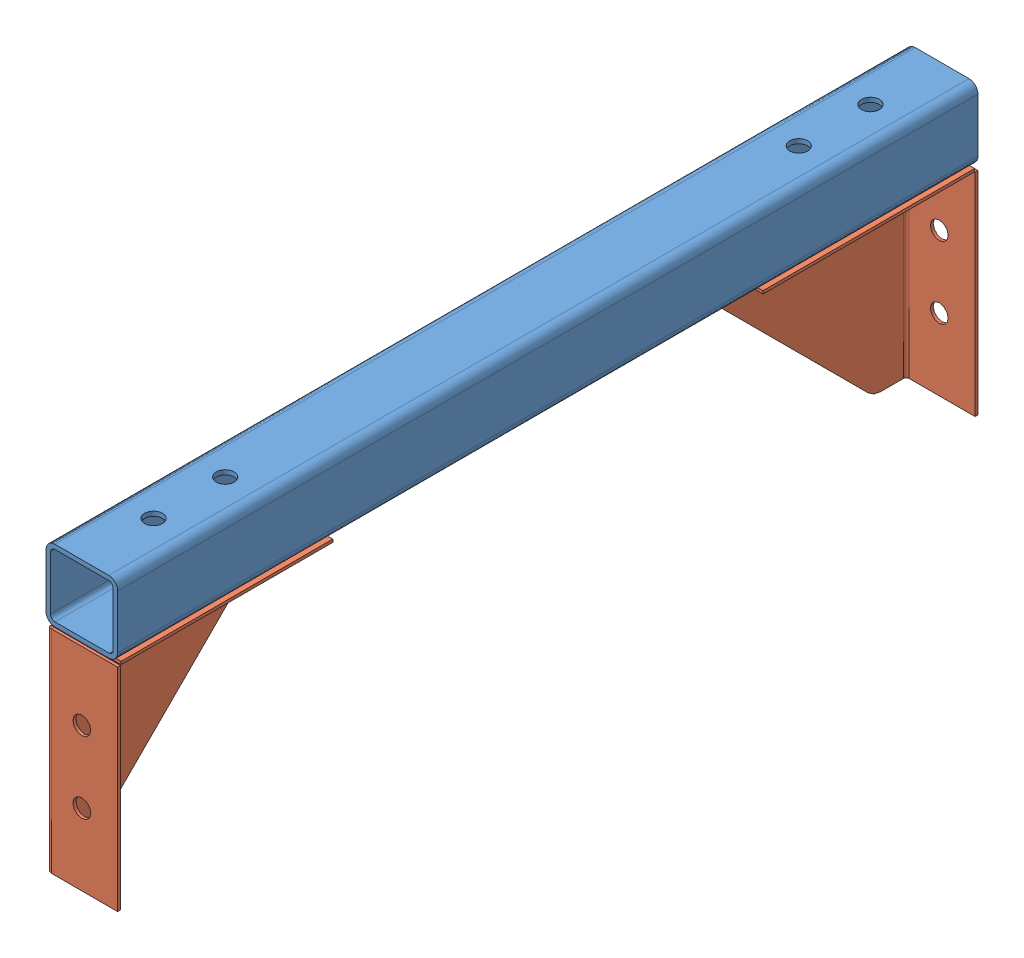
SolidWorks assembly Lower_Brace_&.SLDASM, configuration Default (file format 8000). Lengths in mm.
Overall size (25.4 101.6 304.8).
3 component instances, 2 part files, 2 mates.
Components (placement in the parent):
- Brace_Cross_Bar_&-1: Brace_Cross_Bar_&.SLDPRT [Plain] at (0 -27.3812 0) size (25.4 25.4 304.8)
- Brace_Corner_&-1: Brace_Corner_&.SLDPRT [Default] at (-12.7 -40.0812 152.4) x (0 0 -1) z (1 0 0) size (76.2 76.2 25.4)
- Brace_Corner_&-2: Brace_Corner_&.SLDPRT [Default] at (-12.7 -40.0812 -152.4) x (0 -1 0) z (1 0 0) size (76.2 76.2 25.4)
Mates (geometry in assembly coordinates):
- Coincident1: coincident anti-aligned: plane of Brace_Cross_Bar_&-1 through (12.7 -40.0812 152.4) normal (0 -1 0); plane of Brace_Corner_&-1 through (12.7 -40.0812 76.2) normal (0 1 0)
- Coincident2: coincident anti-aligned: plane of Brace_Cross_Bar_&-1 through (12.7 -40.0812 152.4) normal (0 -1 0); plane of Brace_Corner_&-2 through (12.7 -40.0812 -533.4) normal (0 1 0)
